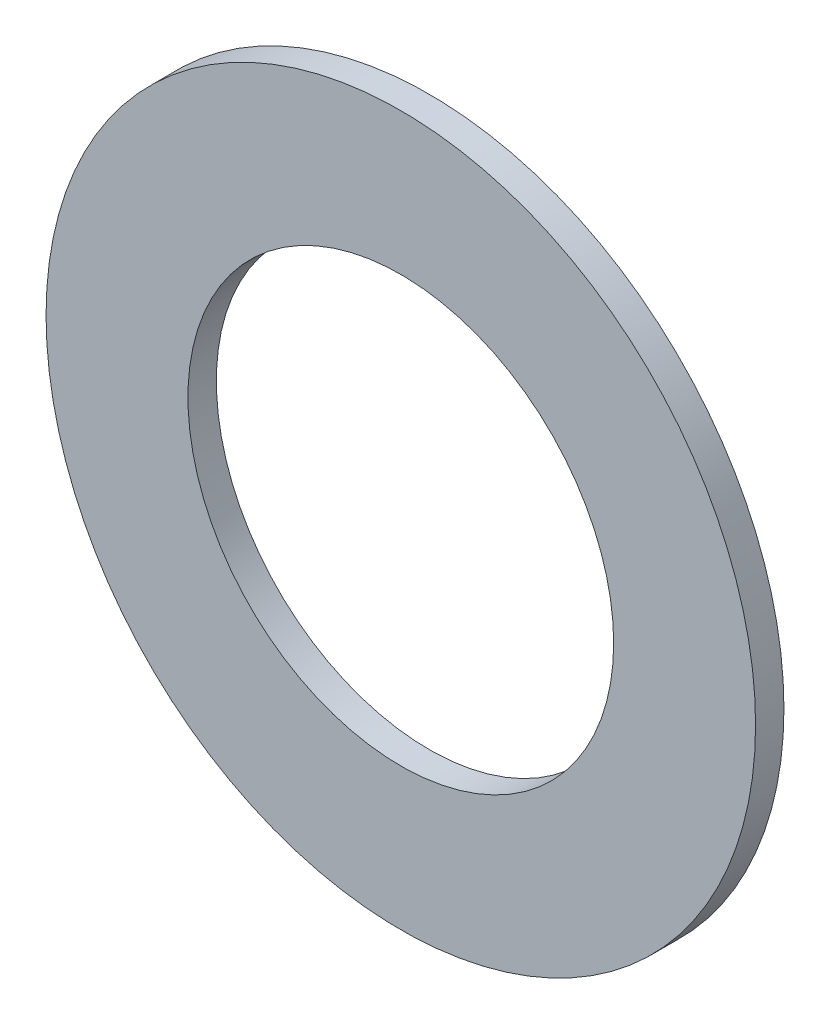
from build123d import *

# Parameters (mm, degrees)
SCHIZZO1_R        = 25
SCHIZZO1_R_2      = 15
ESTRUSIONE1_DEPTH = 2


with BuildPart() as part:
    # Schizzo1 → Estrusione1 (new body)
    with BuildSketch(Plane.XY):
        Circle(SCHIZZO1_R)
        Circle(SCHIZZO1_R_2, mode=Mode.SUBTRACT)
    extrude(amount=ESTRUSIONE1_DEPTH)


solid = part.part
